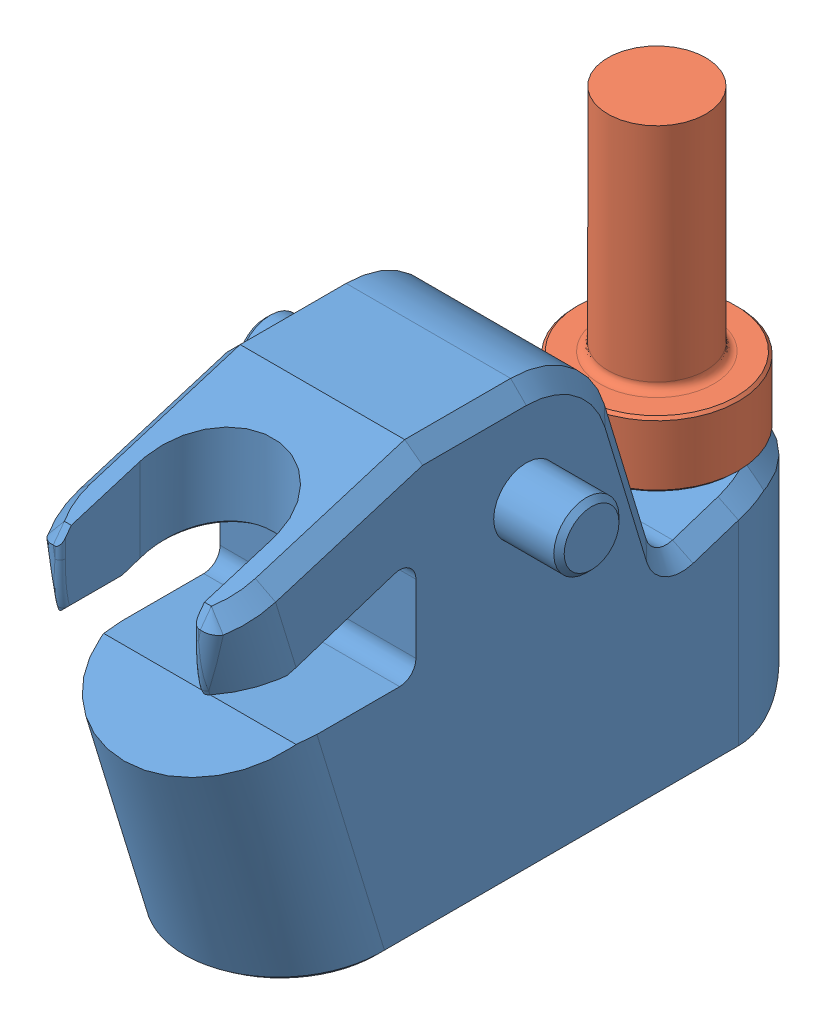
SolidWorks assembly EJA500.sldasm, configuration Default (file format 13000). Lengths in mm.
Overall size (31.75 52.82 59.76).
2 component instances, 2 part files, 6 mates.
Components (placement in the parent):
- EJA500-1: EJA500.sldprt [Default] at origin size (31.75 43.3 59.76)
- KP375L1.130-1: KP375L1.130.sldprt [Default] at (0 -9.652 -22.225) x (-1 0 0) z (0 1 0) size (15.88 15.88 28.7)
Mates (geometry in assembly coordinates):
- Coincident1: coincident: line of EPA500-1 through (0 30.734 15.367) axis (0 0 -1)
- Coincident2: coincident aligned: plane of EPA500-1 through (0 0 0) normal (1 0 0)
- Angle1: planar angle aligned: plane of EPA500-1 through (0 0 0) normal (0 1 0)
- Coincident3: coincident anti-aligned: plane of EP375L1.12-1 through (0 -9.652 -22.225) normal (-1 0 0)
- Distance2: distance = 22.225 mm aligned: plane of EP375L1.12-1 through (0 -9.652 -22.225) normal (0 0 1)
- Coincident4: coincident: line of EPA500-1 through (-7.534 -9.652 -22.86) axis (1 0 0); plane of EP375L1.12-1 through (0 -9.652 -22.225) normal (0 -1 0)
